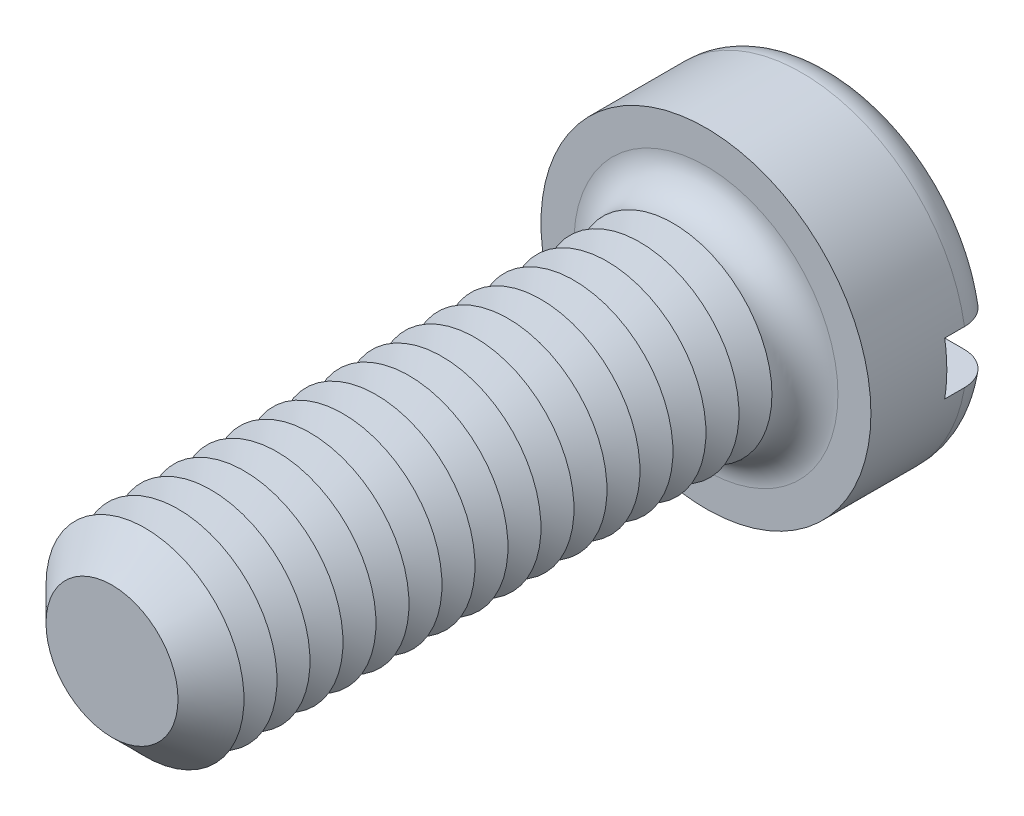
ISO-10303-21;
HEADER;
FILE_DESCRIPTION(('STEP AP214'),'2;1');
FILE_NAME('part.step','',(''),(''),'','','');
FILE_SCHEMA(('AUTOMOTIVE_DESIGN { 1 0 10303 214 1 1 1 1 }'));
ENDSEC;
DATA;
#1=APPLICATION_CONTEXT('core data for automotive mechanical design processes');
#2=APPLICATION_PROTOCOL_DEFINITION('international standard','automotive_design',2000,#1);
#3=PRODUCT_CONTEXT('',#1,'mechanical');
#4=PRODUCT('Part','Part','',(#3));
#5=PRODUCT_RELATED_PRODUCT_CATEGORY('part','',(#4));
#6=PRODUCT_DEFINITION_FORMATION('','',#4);
#7=PRODUCT_DEFINITION_CONTEXT('part definition',#1,'design');
#8=PRODUCT_DEFINITION('design','',#6,#7);
#9=PRODUCT_DEFINITION_SHAPE('','',#8);
#10=(LENGTH_UNIT() NAMED_UNIT(*) SI_UNIT(.MILLI.,.METRE.));
#11=(NAMED_UNIT(*) PLANE_ANGLE_UNIT() SI_UNIT($,.RADIAN.));
#12=(NAMED_UNIT(*) SI_UNIT($,.STERADIAN.) SOLID_ANGLE_UNIT());
#13=UNCERTAINTY_MEASURE_WITH_UNIT(LENGTH_MEASURE(1.E-05),#10,'distance_accuracy_value','');
#14=(GEOMETRIC_REPRESENTATION_CONTEXT(3) GLOBAL_UNCERTAINTY_ASSIGNED_CONTEXT((#13)) GLOBAL_UNIT_ASSIGNED_CONTEXT((#10,
#11,#12)) REPRESENTATION_CONTEXT('',''));
#15=CARTESIAN_POINT('',(0.,0.,0.));
#16=DIRECTION('',(0.,0.,1.));
#17=DIRECTION('',(1.,0.,0.));
#18=AXIS2_PLACEMENT_3D('',#15,#16,#17);
#19=CARTESIAN_POINT('',(0.,0.,-3.9));
#20=DIRECTION('',(0.,0.,1.));
#21=DIRECTION('',(1.,0.,0.));
#22=AXIS2_PLACEMENT_3D('',#19,#20,#21);
#23=PLANE('',#22);
#24=CARTESIAN_POINT('',(0.,0.,-3.9));
#25=DIRECTION('',(0.,0.,1.));
#26=DIRECTION('',(1.,0.,0.));
#27=AXIS2_PLACEMENT_3D('',#24,#25,#26);
#28=CIRCLE('',#27,4.);
#29=CARTESIAN_POINT('',(-3.91918358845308,0.800000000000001,-3.9));
#30=VERTEX_POINT('',#29);
#31=CARTESIAN_POINT('',(3.91918358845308,0.8,-3.9));
#32=VERTEX_POINT('',#31);
#33=EDGE_CURVE('E116',#30,#32,#28,.F.);
#34=ORIENTED_EDGE('',*,*,#33,.T.);
#35=DIRECTION('',(1.,0.,0.));
#36=VECTOR('',#35,1.);
#37=CARTESIAN_POINT('',(-5.,0.800000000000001,-3.9));
#38=LINE('',#37,#36);
#39=EDGE_CURVE('E111',#30,#32,#38,.T.);
#40=ORIENTED_EDGE('',*,*,#39,.F.);
#41=EDGE_LOOP('',(#34,#40));
#42=FACE_BOUND('',#41,.T.);
#43=ADVANCED_FACE('F39',(#42),#23,.F.);
#44=CARTESIAN_POINT('',(0.,0.,-2.9));
#45=DIRECTION('',(0.,0.,1.));
#46=DIRECTION('',(1.,0.,0.));
#47=AXIS2_PLACEMENT_3D('',#44,#45,#46);
#48=TOROIDAL_SURFACE('',#47,4.,1.);
#49=CARTESIAN_POINT('',(-4.76648512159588,0.800000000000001,-3.45304061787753));
#50=CARTESIAN_POINT('',(-4.73486405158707,0.800000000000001,-3.50001565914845));
#51=CARTESIAN_POINT('',(-4.69920787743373,0.800000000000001,-3.54432871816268));
#52=CARTESIAN_POINT('',(-4.62090302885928,0.800000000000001,-3.62634638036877));
#53=CARTESIAN_POINT('',(-4.57824494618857,0.800000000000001,-3.66404194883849));
#54=CARTESIAN_POINT('',(-4.48726975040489,0.800000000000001,-3.73172278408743));
#55=CARTESIAN_POINT('',(-4.43895902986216,0.800000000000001,-3.76171664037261));
#56=CARTESIAN_POINT('',(-4.33804923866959,0.800000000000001,-3.81326437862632));
#57=CARTESIAN_POINT('',(-4.2854512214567,0.800000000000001,-3.8348203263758));
#58=CARTESIAN_POINT('',(-4.17679895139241,0.800000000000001,-3.86918431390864));
#59=CARTESIAN_POINT('',(-4.12071163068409,0.800000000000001,-3.88188775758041));
#60=CARTESIAN_POINT('',(-4.00720729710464,0.800000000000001,-3.89785932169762));
#61=CARTESIAN_POINT('',(-3.94979011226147,0.800000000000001,-3.9011262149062));
#62=CARTESIAN_POINT('',(-3.83429042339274,0.800000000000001,-3.89816676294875));
#63=CARTESIAN_POINT('',(-3.77621176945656,0.800000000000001,-3.89178937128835));
#64=CARTESIAN_POINT('',(-3.66191938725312,0.800000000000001,-3.8694726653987));
#65=CARTESIAN_POINT('',(-3.60570580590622,0.800000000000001,-3.85353259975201));
#66=CARTESIAN_POINT('',(-3.49618749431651,0.800000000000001,-3.81233202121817));
#67=CARTESIAN_POINT('',(-3.44291561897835,0.800000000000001,-3.78698406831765));
#68=CARTESIAN_POINT('',(-3.34140774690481,0.800000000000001,-3.72766098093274));
#69=CARTESIAN_POINT('',(-3.29317182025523,0.800000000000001,-3.69368572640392));
#70=CARTESIAN_POINT('',(-3.20343355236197,0.800000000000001,-3.6182054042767));
#71=CARTESIAN_POINT('',(-3.16189680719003,0.800000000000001,-3.57674128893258));
#72=CARTESIAN_POINT('',(-3.08658236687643,0.800000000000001,-3.48727547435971));
#73=CARTESIAN_POINT('',(-3.05280364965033,0.800000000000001,-3.43927463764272));
#74=CARTESIAN_POINT('',(-2.99489532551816,0.800000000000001,-3.33932895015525));
#75=CARTESIAN_POINT('',(-2.97055012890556,0.800000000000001,-3.28750911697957));
#76=CARTESIAN_POINT('',(-2.93124252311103,0.800000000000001,-3.18042600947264));
#77=CARTESIAN_POINT('',(-2.91627793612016,0.800000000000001,-3.12516353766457));
#78=CARTESIAN_POINT('',(-2.89663075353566,0.800000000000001,-3.01470560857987));
#79=CARTESIAN_POINT('',(-2.89162828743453,0.800000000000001,-2.95956691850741));
#80=CARTESIAN_POINT('',(-2.89112479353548,0.800000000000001,-2.84924961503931));
#81=CARTESIAN_POINT('',(-2.89562264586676,0.800000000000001,-2.79407100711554));
#82=CARTESIAN_POINT('',(-2.91379565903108,0.800000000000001,-2.6861912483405));
#83=CARTESIAN_POINT('',(-2.92731815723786,0.800000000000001,-2.63346424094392));
#84=CARTESIAN_POINT('',(-2.96290888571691,0.800000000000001,-2.53098203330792));
#85=CARTESIAN_POINT('',(-2.98497757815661,0.800000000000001,-2.48122699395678));
#86=CARTESIAN_POINT('',(-3.03728055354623,0.800000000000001,-2.38535286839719));
#87=CARTESIAN_POINT('',(-3.06761989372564,0.800000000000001,-2.33929117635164));
#88=CARTESIAN_POINT('',(-3.13537950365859,0.800000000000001,-2.2527125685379));
#89=CARTESIAN_POINT('',(-3.17280082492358,0.800000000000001,-2.21219647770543));
#90=CARTESIAN_POINT('',(-3.2549164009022,0.800000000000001,-2.13651195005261));
#91=CARTESIAN_POINT('',(-3.29980186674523,0.800000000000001,-2.10155095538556));
#92=CARTESIAN_POINT('',(-3.39467666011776,0.800000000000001,-2.03942270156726));
#93=CARTESIAN_POINT('',(-3.44466673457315,0.800000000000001,-2.01225658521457));
#94=CARTESIAN_POINT('',(-3.5497933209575,0.800000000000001,-1.96576935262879));
#95=CARTESIAN_POINT('',(-3.60503228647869,0.800000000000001,-1.94667963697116));
#96=CARTESIAN_POINT('',(-3.71791613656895,0.800000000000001,-1.91794308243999));
#97=CARTESIAN_POINT('',(-3.77556119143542,0.800000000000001,-1.90829691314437));
#98=CARTESIAN_POINT('',(-3.89221522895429,0.800000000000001,-1.89869331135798));
#99=CARTESIAN_POINT('',(-3.9512319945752,0.800000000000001,-1.89882985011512));
#100=CARTESIAN_POINT('',(-4.06839541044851,0.800000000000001,-1.90907818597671));
#101=CARTESIAN_POINT('',(-4.12654207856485,0.800000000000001,-1.91918977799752));
#102=CARTESIAN_POINT('',(-4.23988103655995,0.800000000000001,-1.9490667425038));
#103=CARTESIAN_POINT('',(-4.29509069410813,0.800000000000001,-1.96876615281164));
#104=CARTESIAN_POINT('',(-4.40134194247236,0.800000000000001,-2.01729572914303));
#105=CARTESIAN_POINT('',(-4.45238383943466,0.800000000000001,-2.04612522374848));
#106=CARTESIAN_POINT('',(-4.54801343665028,0.800000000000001,-2.1116316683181));
#107=CARTESIAN_POINT('',(-4.59268768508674,0.800000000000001,-2.14818225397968));
#108=CARTESIAN_POINT('',(-4.67513924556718,0.800000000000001,-2.22837632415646));
#109=CARTESIAN_POINT('',(-4.71291715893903,0.800000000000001,-2.27201918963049));
#110=CARTESIAN_POINT('',(-4.77986554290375,0.800000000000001,-2.36439990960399));
#111=CARTESIAN_POINT('',(-4.80916462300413,0.800000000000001,-2.41304457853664));
#112=CARTESIAN_POINT('',(-4.85906149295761,0.800000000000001,-2.51460659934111));
#113=CARTESIAN_POINT('',(-4.8796602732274,0.800000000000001,-2.56752346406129));
#114=CARTESIAN_POINT('',(-4.9113264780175,0.800000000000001,-2.67542592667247));
#115=CARTESIAN_POINT('',(-4.92250819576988,0.800000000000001,-2.73037800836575));
#116=CARTESIAN_POINT('',(-4.93542682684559,0.800000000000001,-2.84139649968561));
#117=CARTESIAN_POINT('',(-4.93716171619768,0.800000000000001,-2.89746314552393));
#118=CARTESIAN_POINT('',(-4.93114851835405,0.800000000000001,-3.00876455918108));
#119=CARTESIAN_POINT('',(-4.92345325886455,0.800000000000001,-3.0640022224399));
#120=CARTESIAN_POINT('',(-4.8989032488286,0.800000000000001,-3.17235240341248));
#121=CARTESIAN_POINT('',(-4.88205998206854,0.800000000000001,-3.22546749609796));
#122=CARTESIAN_POINT('',(-4.84819200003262,0.800000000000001,-3.30764066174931));
#123=CARTESIAN_POINT('',(-4.83390853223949,0.800000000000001,-3.33785845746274));
#124=CARTESIAN_POINT('',(-4.80237957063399,0.800000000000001,-3.39670633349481));
#125=CARTESIAN_POINT('',(-4.78513409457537,0.800000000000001,-3.42533642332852));
#126=CARTESIAN_POINT('',(-4.76648512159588,0.800000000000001,-3.45304061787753));
#127=B_SPLINE_CURVE_WITH_KNOTS('',3,(#49,#50,#51,#52,#53,#54,#55,#56,#57,#58,#59,#60,#61,#62,
#63,#64,#65,#66,#67,#68,#69,#70,#71,#72,#73,#74,#75,#76,#77,#78,#79,#80,#81,#82,#83,#84,#85,#86,
#87,#88,#89,#90,#91,#92,#93,#94,#95,#96,#97,#98,#99,#100,#101,#102,#103,#104,#105,#106,#107,
#108,#109,#110,#111,#112,#113,#114,#115,#116,#117,#118,#119,#120,#121,#122,#123,#124,#125,#126),
.UNSPECIFIED.,.T.,.F.,(4,2,2,2,2,2,2,2,2,2,2,2,2,2,2,2,2,2,2,2,2,2,2,2,2,2,2,2,2,2,2,2,2,2,2,2,
2,2,4),(0.,0.169755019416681,0.339740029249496,0.509534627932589,0.67928763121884,
0.851013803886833,1.02276230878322,1.19722869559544,1.37170879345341,1.54785292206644,
1.72399950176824,1.89921049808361,2.07439839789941,2.24530597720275,2.41617386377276,
2.58146078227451,2.74672821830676,2.90926852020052,3.0718176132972,3.2365363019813,
3.40127946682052,3.57118676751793,3.74111896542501,3.91563534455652,4.09016409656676,
4.26636956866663,4.4425714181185,4.61757781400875,4.79257134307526,4.96489650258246,
5.13720662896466,5.30674670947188,5.47626748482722,5.64369988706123,5.81116816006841,
5.97770254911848,6.14402836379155,6.24414438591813,6.34425980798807),.UNSPECIFIED.);
#128=CARTESIAN_POINT('',(-4.93558507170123,0.800000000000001,-2.9));
#129=VERTEX_POINT('',#128);
#130=EDGE_CURVE('E307',#129,#30,#127,.T.);
#131=ORIENTED_EDGE('',*,*,#130,.F.);
#132=CARTESIAN_POINT('',(0.,0.,-2.9));
#133=DIRECTION('',(0.,0.,1.));
#134=DIRECTION('',(1.,0.,0.));
#135=AXIS2_PLACEMENT_3D('',#132,#133,#134);
#136=CIRCLE('',#135,5.);
#137=CARTESIAN_POINT('',(4.93558507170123,0.8,-2.9));
#138=VERTEX_POINT('',#137);
#139=EDGE_CURVE('E125',#138,#129,#136,.T.);
#140=ORIENTED_EDGE('',*,*,#139,.F.);
#141=CARTESIAN_POINT('',(2.98553785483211,0.8,-3.31649797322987));
#142=CARTESIAN_POINT('',(3.00991125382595,0.8,-3.36788093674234));
#143=CARTESIAN_POINT('',(3.03875556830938,0.8,-3.41719756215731));
#144=CARTESIAN_POINT('',(3.1043993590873,0.8,-3.51028676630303));
#145=CARTESIAN_POINT('',(3.1412115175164,0.8,-3.55405032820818));
#146=CARTESIAN_POINT('',(3.22153641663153,0.8,-3.63476402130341));
#147=CARTESIAN_POINT('',(3.26503706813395,0.8,-3.67172618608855));
#148=CARTESIAN_POINT('',(3.35749627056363,0.8,-3.73799476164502));
#149=CARTESIAN_POINT('',(3.4064533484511,0.8,-3.76730323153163));
#150=CARTESIAN_POINT('',(3.5095773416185,0.8,-3.81809642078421));
#151=CARTESIAN_POINT('',(3.56383317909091,0.8,-3.83940072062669));
#152=CARTESIAN_POINT('',(3.67513017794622,0.8,-3.87272481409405));
#153=CARTESIAN_POINT('',(3.7321717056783,0.8,-3.88474338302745));
#154=CARTESIAN_POINT('',(3.84815688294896,0.8,-3.89923413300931));
#155=CARTESIAN_POINT('',(3.90711516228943,0.8,-3.9015896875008));
#156=CARTESIAN_POINT('',(4.02458610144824,0.8,-3.89631753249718));
#157=CARTESIAN_POINT('',(4.08309876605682,0.8,-3.8886899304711));
#158=CARTESIAN_POINT('',(4.19768646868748,0.8,-3.86366584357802));
#159=CARTESIAN_POINT('',(4.25377243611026,0.8,-3.84631948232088));
#160=CARTESIAN_POINT('',(4.3621676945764,0.8,-3.80231797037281));
#161=CARTESIAN_POINT('',(4.41447726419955,0.8,-3.77566350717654));
#162=CARTESIAN_POINT('',(4.51300872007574,0.8,-3.71421163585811));
#163=CARTESIAN_POINT('',(4.5593085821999,0.8,-3.67953927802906));
#164=CARTESIAN_POINT('',(4.64530675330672,0.8,-3.60279495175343));
#165=CARTESIAN_POINT('',(4.68500564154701,0.8,-3.56072363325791));
#166=CARTESIAN_POINT('',(4.75599202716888,0.8,-3.47111750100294));
#167=CARTESIAN_POINT('',(4.7874061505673,0.8,-3.42368298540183));
#168=CARTESIAN_POINT('',(4.84170328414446,0.8,-3.32415927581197));
#169=CARTESIAN_POINT('',(4.86458695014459,0.8,-3.2720704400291));
#170=CARTESIAN_POINT('',(4.90088120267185,0.8,-3.16544016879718));
#171=CARTESIAN_POINT('',(4.91440984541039,0.8,-3.11093889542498));
#172=CARTESIAN_POINT('',(4.93205429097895,0.8,-3.00043391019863));
#173=CARTESIAN_POINT('',(4.93617053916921,0.8,-2.9444302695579));
#174=CARTESIAN_POINT('',(4.93486973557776,0.8,-2.83292218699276));
#175=CARTESIAN_POINT('',(4.92951827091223,0.8,-2.77741696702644));
#176=CARTESIAN_POINT('',(4.90957104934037,0.8,-2.66809456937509));
#177=CARTESIAN_POINT('',(4.89497541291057,0.8,-2.61427736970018));
#178=CARTESIAN_POINT('',(4.85697876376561,0.8,-2.50985095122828));
#179=CARTESIAN_POINT('',(4.83357805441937,0.8,-2.45924162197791));
#180=CARTESIAN_POINT('',(4.77866660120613,0.8,-2.36263484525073));
#181=CARTESIAN_POINT('',(4.74715567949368,0.8,-2.31663749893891));
#182=CARTESIAN_POINT('',(4.67670791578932,0.8,-2.23021464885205));
#183=CARTESIAN_POINT('',(4.6377224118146,0.8,-2.1898288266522));
#184=CARTESIAN_POINT('',(4.55359880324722,0.8,-2.11607828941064));
#185=CARTESIAN_POINT('',(4.50846036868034,0.8,-2.08271395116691));
#186=CARTESIAN_POINT('',(4.41271544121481,0.8,-2.02349513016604));
#187=CARTESIAN_POINT('',(4.36204749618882,0.8,-1.99774003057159));
#188=CARTESIAN_POINT('',(4.257155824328,0.8,-1.95495040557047));
#189=CARTESIAN_POINT('',(4.20293181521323,0.8,-1.93791657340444));
#190=CARTESIAN_POINT('',(4.09154156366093,0.8,-1.91276335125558));
#191=CARTESIAN_POINT('',(4.03434212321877,0.8,-1.90479098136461));
#192=CARTESIAN_POINT('',(3.91941228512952,0.8,-1.89840884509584));
#193=CARTESIAN_POINT('',(3.8616818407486,0.8,-1.89999992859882));
#194=CARTESIAN_POINT('',(3.7464111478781,0.8,-1.91275144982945));
#195=CARTESIAN_POINT('',(3.6888866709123,0.8,-1.92405471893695));
#196=CARTESIAN_POINT('',(3.57652290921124,0.8,-1.95609086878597));
#197=CARTESIAN_POINT('',(3.52168382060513,0.8,-1.97682443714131));
#198=CARTESIAN_POINT('',(3.41589179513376,0.8,-2.02733294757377));
#199=CARTESIAN_POINT('',(3.36496676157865,0.8,-2.05716640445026));
#200=CARTESIAN_POINT('',(3.26890903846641,0.8,-2.12504079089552));
#201=CARTESIAN_POINT('',(3.22377627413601,0.8,-2.16308161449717));
#202=CARTESIAN_POINT('',(3.141135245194,0.8,-2.24593284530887));
#203=CARTESIAN_POINT('',(3.1035541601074,0.8,-2.29067053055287));
#204=CARTESIAN_POINT('',(3.03669700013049,0.8,-2.38597317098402));
#205=CARTESIAN_POINT('',(3.00741914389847,0.8,-2.43653687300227));
#206=CARTESIAN_POINT('',(2.95891799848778,0.8,-2.54052959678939));
#207=CARTESIAN_POINT('',(2.93943249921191,0.8,-2.59383627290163));
#208=CARTESIAN_POINT('',(2.9100081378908,0.8,-2.70303736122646));
#209=CARTESIAN_POINT('',(2.90006970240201,0.8,-2.75893188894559));
#210=CARTESIAN_POINT('',(2.89027863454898,0.8,-2.86986958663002));
#211=CARTESIAN_POINT('',(2.89012791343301,0.8,-2.92488680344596));
#212=CARTESIAN_POINT('',(2.89917145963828,0.8,-3.03409648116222));
#213=CARTESIAN_POINT('',(2.90835313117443,0.8,-3.08828995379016));
#214=CARTESIAN_POINT('',(2.92977618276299,0.8,-3.17141652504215));
#215=CARTESIAN_POINT('',(2.93899011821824,0.8,-3.20116372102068));
#216=CARTESIAN_POINT('',(2.96020249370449,0.8,-3.25964614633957));
#217=CARTESIAN_POINT('',(2.97220082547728,0.8,-3.28838141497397));
#218=CARTESIAN_POINT('',(2.98553785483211,0.8,-3.31649797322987));
#219=B_SPLINE_CURVE_WITH_KNOTS('',3,(#141,#142,#143,#144,#145,#146,#147,#148,#149,#150,#151,
#152,#153,#154,#155,#156,#157,#158,#159,#160,#161,#162,#163,#164,#165,#166,#167,#168,#169,#170,
#171,#172,#173,#174,#175,#176,#177,#178,#179,#180,#181,#182,#183,#184,#185,#186,#187,#188,#189,
#190,#191,#192,#193,#194,#195,#196,#197,#198,#199,#200,#201,#202,#203,#204,#205,#206,#207,#208,
#209,#210,#211,#212,#213,#214,#215,#216,#217,#218),.UNSPECIFIED.,.T.,.F.,(4,2,2,2,2,2,2,2,2,2,2,
2,2,2,2,2,2,2,2,2,2,2,2,2,2,2,2,2,2,2,2,2,2,2,2,2,2,2,4),(0.,0.170493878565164,
0.341261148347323,0.511723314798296,0.682139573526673,0.856194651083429,1.03027268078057,
1.20644565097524,1.38261672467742,1.55788746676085,1.73314526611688,1.90583484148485,
2.07850925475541,2.24836742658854,2.41821253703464,2.58587311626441,2.75352576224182,
2.92002154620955,3.08651516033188,3.25300303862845,3.41949456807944,3.58710926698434,
3.75473295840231,3.92445790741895,4.09419634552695,4.26665110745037,4.43912119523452,
4.61417197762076,4.78923552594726,4.96544940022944,5.1416609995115,5.31608191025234,
5.49046537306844,5.65989063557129,5.82932346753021,5.99359365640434,6.157642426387,
6.250939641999,6.34423323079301),.UNSPECIFIED.);
#220=EDGE_CURVE('E309',#32,#138,#219,.T.);
#221=ORIENTED_EDGE('',*,*,#220,.F.);
#222=ORIENTED_EDGE('',*,*,#33,.F.);
#223=EDGE_LOOP('',(#131,#140,#221,#222));
#224=FACE_BOUND('',#223,.T.);
#225=ADVANCED_FACE('F291',(#224),#48,.T.);
#226=CARTESIAN_POINT('',(0.,0.,-3.9));
#227=DIRECTION('',(0.,0.,1.));
#228=DIRECTION('',(1.,0.,0.));
#229=AXIS2_PLACEMENT_3D('',#226,#227,#228);
#230=CYLINDRICAL_SURFACE('',#229,5.);
#231=DIRECTION('',(0.,0.,1.));
#232=VECTOR('',#231,1.);
#233=CARTESIAN_POINT('',(4.93558507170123,0.8,-3.9));
#234=LINE('',#233,#232);
#235=CARTESIAN_POINT('',(4.93558507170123,0.8,-2.3));
#236=VERTEX_POINT('',#235);
#237=EDGE_CURVE('E323',#138,#236,#234,.T.);
#238=ORIENTED_EDGE('',*,*,#237,.F.);
#239=ORIENTED_EDGE('',*,*,#139,.T.);
#240=DIRECTION('',(0.,0.,1.));
#241=VECTOR('',#240,1.);
#242=CARTESIAN_POINT('',(-4.93558507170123,0.800000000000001,-3.9));
#243=LINE('',#242,#241);
#244=CARTESIAN_POINT('',(-4.93558507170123,0.800000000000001,-2.3));
#245=VERTEX_POINT('',#244);
#246=EDGE_CURVE('E63',#245,#129,#243,.F.);
#247=ORIENTED_EDGE('',*,*,#246,.F.);
#248=CARTESIAN_POINT('',(0.,0.,-2.3));
#249=DIRECTION('',(0.,0.,-1.));
#250=DIRECTION('',(-1.,0.,0.));
#251=AXIS2_PLACEMENT_3D('',#248,#249,#250);
#252=CIRCLE('',#251,5.);
#253=CARTESIAN_POINT('',(-4.93558507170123,-0.799999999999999,-2.3));
#254=VERTEX_POINT('',#253);
#255=EDGE_CURVE('E43',#245,#254,#252,.F.);
#256=ORIENTED_EDGE('',*,*,#255,.T.);
#257=DIRECTION('',(0.,0.,1.));
#258=VECTOR('',#257,1.);
#259=CARTESIAN_POINT('',(-4.93558507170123,-0.799999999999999,-3.9));
#260=LINE('',#259,#258);
#261=CARTESIAN_POINT('',(-4.93558507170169,-0.799999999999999,-2.89999999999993));
#262=VERTEX_POINT('',#261);
#263=EDGE_CURVE('E320',#262,#254,#260,.T.);
#264=ORIENTED_EDGE('',*,*,#263,.F.);
#265=CARTESIAN_POINT('',(4.93558507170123,-0.8,-2.9));
#266=VERTEX_POINT('',#265);
#267=EDGE_CURVE('E127',#262,#266,#136,.T.);
#268=ORIENTED_EDGE('',*,*,#267,.T.);
#269=DIRECTION('',(0.,0.,1.));
#270=VECTOR('',#269,1.);
#271=CARTESIAN_POINT('',(4.93558507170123,-0.8,-3.9));
#272=LINE('',#271,#270);
#273=CARTESIAN_POINT('',(4.93558507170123,-0.8,-2.3));
#274=VERTEX_POINT('',#273);
#275=EDGE_CURVE('E55',#274,#266,#272,.F.);
#276=ORIENTED_EDGE('',*,*,#275,.F.);
#277=EDGE_CURVE('E11',#274,#236,#252,.F.);
#278=ORIENTED_EDGE('',*,*,#277,.T.);
#279=EDGE_LOOP('',(#238,#239,#247,#256,#264,#268,#276,#278));
#280=FACE_BOUND('',#279,.T.);
#281=CARTESIAN_POINT('',(0.,0.,0.));
#282=DIRECTION('',(0.,0.,1.));
#283=DIRECTION('',(1.,0.,0.));
#284=AXIS2_PLACEMENT_3D('',#281,#282,#283);
#285=CIRCLE('',#284,5.);
#286=CARTESIAN_POINT('',(5.,0.,0.));
#287=VERTEX_POINT('',#286);
#288=EDGE_CURVE('E326',#287,#287,#285,.T.);
#289=ORIENTED_EDGE('',*,*,#288,.F.);
#290=EDGE_LOOP('',(#289));
#291=FACE_BOUND('',#290,.T.);
#292=ADVANCED_FACE('F287',(#280,#291),#230,.T.);
#293=CARTESIAN_POINT('',(3.91918358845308,-0.8,-3.9));
#294=VERTEX_POINT('',#293);
#295=CARTESIAN_POINT('',(-3.91918358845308,-0.799999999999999,-3.9));
#296=VERTEX_POINT('',#295);
#297=EDGE_CURVE('E109',#294,#296,#28,.F.);
#298=ORIENTED_EDGE('',*,*,#297,.T.);
#299=DIRECTION('',(-1.,0.,0.));
#300=VECTOR('',#299,1.);
#301=CARTESIAN_POINT('',(-5.,-0.799999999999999,-3.9));
#302=LINE('',#301,#300);
#303=EDGE_CURVE('E96',#294,#296,#302,.T.);
#304=ORIENTED_EDGE('',*,*,#303,.F.);
#305=EDGE_LOOP('',(#298,#304));
#306=FACE_BOUND('',#305,.T.);
#307=ADVANCED_FACE('F108',(#306),#23,.F.);
#308=CARTESIAN_POINT('',(0.,0.,0.));
#309=DIRECTION('',(0.,0.,1.));
#310=DIRECTION('',(1.,0.,0.));
#311=AXIS2_PLACEMENT_3D('',#308,#309,#310);
#312=PLANE('',#311);
#313=CARTESIAN_POINT('',(0.,0.,0.));
#314=DIRECTION('',(0.,0.,1.));
#315=DIRECTION('',(1.,0.,0.));
#316=AXIS2_PLACEMENT_3D('',#313,#314,#315);
#317=CIRCLE('',#316,4.);
#318=CARTESIAN_POINT('',(4.,0.,0.));
#319=VERTEX_POINT('',#318);
#320=EDGE_CURVE('E115',#319,#319,#317,.F.);
#321=ORIENTED_EDGE('',*,*,#320,.T.);
#322=EDGE_LOOP('',(#321));
#323=FACE_BOUND('',#322,.T.);
#324=ORIENTED_EDGE('',*,*,#288,.T.);
#325=EDGE_LOOP('',(#324));
#326=FACE_BOUND('',#325,.T.);
#327=ADVANCED_FACE('F286',(#323,#326),#312,.T.);
#328=CARTESIAN_POINT('',(-4.76648512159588,-0.799999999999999,-3.45304061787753));
#329=CARTESIAN_POINT('',(-4.7975694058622,-0.799999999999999,-3.40685392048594));
#330=CARTESIAN_POINT('',(-4.82479903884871,-0.799999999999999,-3.35802740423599));
#331=CARTESIAN_POINT('',(-4.87070632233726,-0.799999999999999,-3.25646127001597));
#332=CARTESIAN_POINT('',(-4.8893747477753,-0.799999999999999,-3.20371750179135));
#333=CARTESIAN_POINT('',(-4.91756720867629,-0.799999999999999,-3.09584501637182));
#334=CARTESIAN_POINT('',(-4.92709302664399,-0.799999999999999,-3.04071676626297));
#335=CARTESIAN_POINT('',(-4.93671217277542,-0.799999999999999,-2.92965669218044));
#336=CARTESIAN_POINT('',(-4.93680767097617,-0.799999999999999,-2.87372505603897));
#337=CARTESIAN_POINT('',(-4.92758675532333,-0.799999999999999,-2.76284675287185));
#338=CARTESIAN_POINT('',(-4.91830421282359,-0.799999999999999,-2.70789726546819));
#339=CARTESIAN_POINT('',(-4.89065741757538,-0.799999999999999,-2.60033228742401));
#340=CARTESIAN_POINT('',(-4.87229291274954,-0.799999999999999,-2.54771686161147));
#341=CARTESIAN_POINT('',(-4.82699855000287,-0.799999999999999,-2.44622441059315));
#342=CARTESIAN_POINT('',(-4.80005659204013,-0.799999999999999,-2.39735278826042));
#343=CARTESIAN_POINT('',(-4.73841244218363,-0.799999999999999,-2.30477947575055));
#344=CARTESIAN_POINT('',(-4.70371003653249,-0.799999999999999,-2.26107792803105));
#345=CARTESIAN_POINT('',(-4.62724516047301,-0.799999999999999,-2.17969334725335));
#346=CARTESIAN_POINT('',(-4.58542787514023,-0.799999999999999,-2.14206183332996));
#347=CARTESIAN_POINT('',(-4.49614171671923,-0.799999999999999,-2.07424284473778));
#348=CARTESIAN_POINT('',(-4.44867251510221,-0.799999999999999,-2.04405580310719));
#349=CARTESIAN_POINT('',(-4.34875035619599,-0.799999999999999,-1.99153688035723));
#350=CARTESIAN_POINT('',(-4.29623870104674,-0.799999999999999,-1.96931670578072));
#351=CARTESIAN_POINT('',(-4.18826905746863,-0.799999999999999,-1.93384994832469));
#352=CARTESIAN_POINT('',(-4.1328108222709,-0.799999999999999,-1.92060411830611));
#353=CARTESIAN_POINT('',(-4.01956054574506,-0.799999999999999,-1.90323798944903));
#354=CARTESIAN_POINT('',(-3.96174522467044,-0.799999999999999,-1.89926947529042));
#355=CARTESIAN_POINT('',(-3.84625419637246,-0.799999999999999,-1.90095183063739));
#356=CARTESIAN_POINT('',(-3.78857850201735,-0.799999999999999,-1.90660355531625));
#357=CARTESIAN_POINT('',(-3.67415602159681,-0.799999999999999,-1.92748272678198));
#358=CARTESIAN_POINT('',(-3.61743328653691,-0.799999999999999,-1.94284216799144));
#359=CARTESIAN_POINT('',(-3.50734962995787,-0.799999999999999,-1.9828275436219));
#360=CARTESIAN_POINT('',(-3.4539889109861,-0.799999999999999,-2.00745403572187));
#361=CARTESIAN_POINT('',(-3.35197118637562,-0.799999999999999,-2.06542964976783));
#362=CARTESIAN_POINT('',(-3.30333217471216,-0.799999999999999,-2.0988104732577));
#363=CARTESIAN_POINT('',(-3.21244692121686,-0.799999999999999,-2.17337326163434));
#364=CARTESIAN_POINT('',(-3.17020039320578,-0.799999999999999,-2.21455487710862));
#365=CARTESIAN_POINT('',(-3.0940098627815,-0.799999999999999,-2.30296695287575));
#366=CARTESIAN_POINT('',(-3.05995540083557,-0.799999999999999,-2.35010211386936));
#367=CARTESIAN_POINT('',(-3.00053815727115,-0.799999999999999,-2.4495670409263));
#368=CARTESIAN_POINT('',(-2.97517362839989,-0.799999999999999,-2.50189576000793));
#369=CARTESIAN_POINT('',(-2.93470320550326,-0.799999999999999,-2.60853979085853));
#370=CARTESIAN_POINT('',(-2.91930557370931,-0.799999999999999,-2.66274437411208));
#371=CARTESIAN_POINT('',(-2.89812734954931,-0.799999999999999,-2.77299836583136));
#372=CARTESIAN_POINT('',(-2.89234481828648,-0.799999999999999,-2.82904740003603));
#373=CARTESIAN_POINT('',(-2.89064073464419,-0.799999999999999,-2.93970612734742));
#374=CARTESIAN_POINT('',(-2.89444549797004,-0.799999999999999,-2.99431180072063));
#375=CARTESIAN_POINT('',(-2.9112006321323,-0.799999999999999,-3.10209766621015));
#376=CARTESIAN_POINT('',(-2.9241507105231,-0.799999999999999,-3.1552779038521));
#377=CARTESIAN_POINT('',(-2.95868580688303,-0.799999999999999,-3.25858631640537));
#378=CARTESIAN_POINT('',(-2.98024709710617,-0.799999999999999,-3.30872244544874));
#379=CARTESIAN_POINT('',(-3.03128544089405,-0.799999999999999,-3.40478519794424));
#380=CARTESIAN_POINT('',(-3.06076335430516,-0.799999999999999,-3.45071136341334));
#381=CARTESIAN_POINT('',(-3.12753448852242,-0.799999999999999,-3.53826932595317));
#382=CARTESIAN_POINT('',(-3.16500083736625,-0.799999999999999,-3.57976901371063));
#383=CARTESIAN_POINT('',(-3.24617503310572,-0.799999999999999,-3.65613204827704));
#384=CARTESIAN_POINT('',(-3.28988388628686,-0.799999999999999,-3.69099432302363));
#385=CARTESIAN_POINT('',(-3.38380639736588,-0.799999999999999,-3.75424083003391));
#386=CARTESIAN_POINT('',(-3.43418287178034,-0.799999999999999,-3.78238342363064));
#387=CARTESIAN_POINT('',(-3.53887888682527,-0.799999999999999,-3.83000231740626));
#388=CARTESIAN_POINT('',(-3.59319889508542,-0.799999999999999,-3.84947758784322));
#389=CARTESIAN_POINT('',(-3.70539237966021,-0.799999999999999,-3.87954336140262));
#390=CARTESIAN_POINT('',(-3.76331464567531,-0.799999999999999,-3.88995217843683));
#391=CARTESIAN_POINT('',(-3.88008461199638,-0.799999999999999,-3.9009132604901));
#392=CARTESIAN_POINT('',(-3.93893230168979,-0.799999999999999,-3.9014656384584));
#393=CARTESIAN_POINT('',(-4.05594892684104,-0.799999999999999,-3.89264187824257));
#394=CARTESIAN_POINT('',(-4.11411702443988,-0.799999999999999,-3.88325457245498));
#395=CARTESIAN_POINT('',(-4.22802928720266,-0.799999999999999,-3.85472582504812));
#396=CARTESIAN_POINT('',(-4.28377297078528,-0.799999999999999,-3.83558245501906));
#397=CARTESIAN_POINT('',(-4.39054463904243,-0.799999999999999,-3.78829842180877));
#398=CARTESIAN_POINT('',(-4.44161887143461,-0.799999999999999,-3.76026208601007));
#399=CARTESIAN_POINT('',(-4.53818016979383,-0.799999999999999,-3.69589278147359));
#400=CARTESIAN_POINT('',(-4.58367442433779,-0.799999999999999,-3.65957066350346));
#401=CARTESIAN_POINT('',(-4.65208830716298,-0.799999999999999,-3.59453310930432));
#402=CARTESIAN_POINT('',(-4.67711825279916,-0.799999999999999,-3.56800018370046));
#403=CARTESIAN_POINT('',(-4.72414423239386,-0.799999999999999,-3.51236863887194));
#404=CARTESIAN_POINT('',(-4.74614029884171,-0.799999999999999,-3.48327004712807));
#405=CARTESIAN_POINT('',(-4.76648512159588,-0.799999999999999,-3.45304061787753));
#406=B_SPLINE_CURVE_WITH_KNOTS('',3,(#328,#329,#330,#331,#332,#333,#334,#335,#336,#337,#338,
#339,#340,#341,#342,#343,#344,#345,#346,#347,#348,#349,#350,#351,#352,#353,#354,#355,#356,#357,
#358,#359,#360,#361,#362,#363,#364,#365,#366,#367,#368,#369,#370,#371,#372,#373,#374,#375,#376,
#377,#378,#379,#380,#381,#382,#383,#384,#385,#386,#387,#388,#389,#390,#391,#392,#393,#394,#395,
#396,#397,#398,#399,#400,#401,#402,#403,#404,#405),.UNSPECIFIED.,.T.,.F.,(4,2,2,2,2,2,2,2,2,2,2,
2,2,2,2,2,2,2,2,2,2,2,2,2,2,2,2,2,2,2,2,2,2,2,2,2,2,2,4),(0.,0.166886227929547,
0.333951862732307,0.500984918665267,0.667979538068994,0.834373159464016,1.00077139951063,
1.16740542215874,1.33404403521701,1.50202999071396,1.67002571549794,1.84029248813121,
2.01057354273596,2.18362161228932,2.35668506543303,2.53215380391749,2.70763310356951,
2.88375684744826,3.05987270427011,3.23346085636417,3.40701408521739,3.57522519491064,
3.74340238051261,3.90683338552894,4.0702591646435,4.23323770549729,4.39623395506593,
4.56320691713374,4.7302068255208,4.90252468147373,5.07486300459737,5.25058028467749,
5.42629555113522,5.60220844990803,5.77815613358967,5.95211162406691,6.12584060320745,
6.23506966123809,6.34429754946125),.UNSPECIFIED.);
#407=EDGE_CURVE('E103',#296,#262,#406,.T.);
#408=ORIENTED_EDGE('',*,*,#407,.F.);
#409=ORIENTED_EDGE('',*,*,#297,.F.);
#410=CARTESIAN_POINT('',(2.98553785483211,-0.8,-3.31649797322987));
#411=CARTESIAN_POINT('',(2.96216773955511,-0.8,-3.26721849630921));
#412=CARTESIAN_POINT('',(2.94287503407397,-0.8,-3.21596872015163));
#413=CARTESIAN_POINT('',(2.91313258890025,-0.8,-3.11092723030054));
#414=CARTESIAN_POINT('',(2.9026902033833,-0.8,-3.0571334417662));
#415=CARTESIAN_POINT('',(2.89104377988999,-0.8,-2.94853922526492));
#416=CARTESIAN_POINT('',(2.88984130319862,-0.8,-2.89373862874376));
#417=CARTESIAN_POINT('',(2.89672585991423,-0.8,-2.78473646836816));
#418=CARTESIAN_POINT('',(2.90481120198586,-0.8,-2.73053479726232));
#419=CARTESIAN_POINT('',(2.92989134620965,-0.8,-2.62460092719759));
#420=CARTESIAN_POINT('',(2.94682969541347,-0.8,-2.57285532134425));
#421=CARTESIAN_POINT('',(2.9889990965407,-0.8,-2.47286425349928));
#422=CARTESIAN_POINT('',(3.01423103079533,-0.8,-2.42461916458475));
#423=CARTESIAN_POINT('',(3.07271536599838,-0.8,-2.33201565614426));
#424=CARTESIAN_POINT('',(3.10610710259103,-0.8,-2.28774532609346));
#425=CARTESIAN_POINT('',(3.17963417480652,-0.8,-2.205215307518));
#426=CARTESIAN_POINT('',(3.21977054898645,-0.8,-2.16695654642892));
#427=CARTESIAN_POINT('',(3.3070361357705,-0.8,-2.09624274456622));
#428=CARTESIAN_POINT('',(3.35434874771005,-0.8,-2.06401396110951));
#429=CARTESIAN_POINT('',(3.45361131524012,-0.8,-2.00773436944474));
#430=CARTESIAN_POINT('',(3.50556189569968,-0.8,-1.98368466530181));
#431=CARTESIAN_POINT('',(3.61398433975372,-0.8,-1.94389460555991));
#432=CARTESIAN_POINT('',(3.67053506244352,-0.8,-1.92836880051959));
#433=CARTESIAN_POINT('',(3.78543606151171,-0.8,-1.90696594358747));
#434=CARTESIAN_POINT('',(3.84378643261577,-0.8,-1.90108940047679));
#435=CARTESIAN_POINT('',(3.96100201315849,-0.8,-1.89918115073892));
#436=CARTESIAN_POINT('',(4.01986821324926,-0.8,-1.90320860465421));
#437=CARTESIAN_POINT('',(4.13606891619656,-0.8,-1.9211820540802));
#438=CARTESIAN_POINT('',(4.19340347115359,-0.8,-1.93512771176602));
#439=CARTESIAN_POINT('',(4.30434213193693,-0.8,-1.97243705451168));
#440=CARTESIAN_POINT('',(4.35797549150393,-0.8,-1.99571368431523));
#441=CARTESIAN_POINT('',(4.46048254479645,-0.8,-2.0510826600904));
#442=CARTESIAN_POINT('',(4.50935662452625,-0.8,-2.08317429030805));
#443=CARTESIAN_POINT('',(4.60012348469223,-0.8,-2.15471647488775));
#444=CARTESIAN_POINT('',(4.64211506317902,-0.8,-2.19404167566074));
#445=CARTESIAN_POINT('',(4.71877054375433,-0.8,-2.27928299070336));
#446=CARTESIAN_POINT('',(4.75343508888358,-0.8,-2.32519852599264));
#447=CARTESIAN_POINT('',(4.81388799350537,-0.8,-2.4215411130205));
#448=CARTESIAN_POINT('',(4.83980652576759,-0.8,-2.47188650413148));
#449=CARTESIAN_POINT('',(4.88271402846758,-0.8,-2.57624865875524));
#450=CARTESIAN_POINT('',(4.89970360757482,-0.8,-2.63026517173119));
#451=CARTESIAN_POINT('',(4.92409334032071,-0.8,-2.73978844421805));
#452=CARTESIAN_POINT('',(4.93159814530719,-0.8,-2.79527191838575));
#453=CARTESIAN_POINT('',(4.93713723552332,-0.8,-2.90670881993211));
#454=CARTESIAN_POINT('',(4.9351718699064,-0.8,-2.9626622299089));
#455=CARTESIAN_POINT('',(4.92186293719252,-0.8,-3.07317093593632));
#456=CARTESIAN_POINT('',(4.91056393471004,-0.8,-3.12773160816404));
#457=CARTESIAN_POINT('',(4.87898532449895,-0.8,-3.234187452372));
#458=CARTESIAN_POINT('',(4.85870572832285,-0.8,-3.28608262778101));
#459=CARTESIAN_POINT('',(4.80971634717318,-0.8,-3.38586723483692));
#460=CARTESIAN_POINT('',(4.78098824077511,-0.8,-3.43374766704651));
#461=CARTESIAN_POINT('',(4.71596686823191,-0.8,-3.52405937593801));
#462=CARTESIAN_POINT('',(4.67967336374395,-0.8,-3.56649048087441));
#463=CARTESIAN_POINT('',(4.60022577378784,-0.8,-3.64511036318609));
#464=CARTESIAN_POINT('',(4.5570143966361,-0.8,-3.6812412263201));
#465=CARTESIAN_POINT('',(4.4652099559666,-0.8,-3.7458530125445));
#466=CARTESIAN_POINT('',(4.41661654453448,-0.8,-3.77433344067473));
#467=CARTESIAN_POINT('',(4.31470683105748,-0.8,-3.82326981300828));
#468=CARTESIAN_POINT('',(4.26133399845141,-0.8,-3.84360800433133));
#469=CARTESIAN_POINT('',(4.15196444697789,-0.8,-3.87519515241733));
#470=CARTESIAN_POINT('',(4.09596750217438,-0.8,-3.88644332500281));
#471=CARTESIAN_POINT('',(3.98196469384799,-0.8,-3.89971870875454));
#472=CARTESIAN_POINT('',(3.92394096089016,-0.8,-3.901592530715));
#473=CARTESIAN_POINT('',(3.8083852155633,-0.8,-3.89570840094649));
#474=CARTESIAN_POINT('',(3.75085322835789,-0.8,-3.88794995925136));
#475=CARTESIAN_POINT('',(3.6371167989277,-0.8,-3.86287824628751));
#476=CARTESIAN_POINT('',(3.58093962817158,-0.8,-3.84544111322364));
#477=CARTESIAN_POINT('',(3.47227948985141,-0.8,-3.80139971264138));
#478=CARTESIAN_POINT('',(3.41979762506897,-0.8,-3.77479272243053));
#479=CARTESIAN_POINT('',(3.31994061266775,-0.8,-3.71304199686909));
#480=CARTESIAN_POINT('',(3.27257854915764,-0.8,-3.67787710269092));
#481=CARTESIAN_POINT('',(3.18459619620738,-0.8,-3.59999704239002));
#482=CARTESIAN_POINT('',(3.14396747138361,-0.8,-3.55729146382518));
#483=CARTESIAN_POINT('',(3.08341110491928,-0.8,-3.48140072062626));
#484=CARTESIAN_POINT('',(3.06118126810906,-0.8,-3.45002448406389));
#485=CARTESIAN_POINT('',(3.02047302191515,-0.8,-3.38492378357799));
#486=CARTESIAN_POINT('',(3.00199451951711,-0.8,-3.35119937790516));
#487=CARTESIAN_POINT('',(2.98553785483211,-0.8,-3.31649797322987));
#488=B_SPLINE_CURVE_WITH_KNOTS('',3,(#410,#411,#412,#413,#414,#415,#416,#417,#418,#419,#420,
#421,#422,#423,#424,#425,#426,#427,#428,#429,#430,#431,#432,#433,#434,#435,#436,#437,#438,#439,
#440,#441,#442,#443,#444,#445,#446,#447,#448,#449,#450,#451,#452,#453,#454,#455,#456,#457,#458,
#459,#460,#461,#462,#463,#464,#465,#466,#467,#468,#469,#470,#471,#472,#473,#474,#475,#476,#477,
#478,#479,#480,#481,#482,#483,#484,#485,#486,#487),.UNSPECIFIED.,.T.,.F.,(4,2,2,2,2,2,2,2,2,2,2,
2,2,2,2,2,2,2,2,2,2,2,2,2,2,2,2,2,2,2,2,2,2,2,2,2,2,2,4),(0.,0.163484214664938,
0.327104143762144,0.490751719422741,0.654369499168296,0.816956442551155,0.979560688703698,
1.14516376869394,1.31079237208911,1.48174839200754,1.6527274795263,1.82783306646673,
2.00294788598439,2.17911127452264,2.35526866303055,2.52981944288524,2.70435605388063,
2.87611266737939,3.04785420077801,3.21691347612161,3.38596122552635,3.55312700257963,
3.72028661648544,3.88665268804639,4.053018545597,4.2197478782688,4.38648246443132,
4.55467705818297,4.72288253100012,4.89343959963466,5.06401138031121,5.23736524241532,
5.41072792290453,5.58636211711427,5.76204850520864,5.93817375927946,6.11407667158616,
6.22920111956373,6.34432271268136),.UNSPECIFIED.);
#489=EDGE_CURVE('E92',#266,#294,#488,.T.);
#490=ORIENTED_EDGE('',*,*,#489,.F.);
#491=ORIENTED_EDGE('',*,*,#267,.F.);
#492=EDGE_LOOP('',(#408,#409,#490,#491));
#493=FACE_BOUND('',#492,.T.);
#494=ADVANCED_FACE('F113',(#493),#48,.T.);
#495=CARTESIAN_POINT('',(0.,0.,1.));
#496=DIRECTION('',(0.,0.,1.));
#497=DIRECTION('',(1.,0.,0.));
#498=AXIS2_PLACEMENT_3D('',#495,#496,#497);
#499=TOROIDAL_SURFACE('',#498,4.,1.);
#500=ORIENTED_EDGE('',*,*,#320,.F.);
#501=EDGE_LOOP('',(#500));
#502=FACE_BOUND('',#501,.T.);
#503=CARTESIAN_POINT('',(0.,0.,1.));
#504=DIRECTION('',(0.,0.,-1.));
#505=DIRECTION('',(-1.,0.,0.));
#506=AXIS2_PLACEMENT_3D('',#503,#504,#505);
#507=CIRCLE('',#506,3.);
#508=CARTESIAN_POINT('',(-3.,0.,1.));
#509=VERTEX_POINT('',#508);
#510=EDGE_CURVE('E331',#509,#509,#507,.T.);
#511=ORIENTED_EDGE('',*,*,#510,.T.);
#512=EDGE_LOOP('',(#511));
#513=FACE_BOUND('',#512,.T.);
#514=ADVANCED_FACE('F279',(#502,#513),#499,.F.);
#515=CARTESIAN_POINT('',(0.,0.,1.5));
#516=DIRECTION('',(0.,0.,-1.));
#517=DIRECTION('',(-1.,0.,0.));
#518=AXIS2_PLACEMENT_3D('',#515,#516,#517);
#519=CONICAL_SURFACE('',#518,2.13397459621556,1.0471975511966);
#520=ORIENTED_EDGE('',*,*,#510,.F.);
#521=EDGE_LOOP('',(#520));
#522=FACE_BOUND('',#521,.T.);
#523=CARTESIAN_POINT('',(0.,0.,1.5));
#524=DIRECTION('',(0.,0.,-1.));
#525=DIRECTION('',(-1.,0.,0.));
#526=AXIS2_PLACEMENT_3D('',#523,#524,#525);
#527=CIRCLE('',#526,2.13397459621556);
#528=CARTESIAN_POINT('',(-2.13397459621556,0.,1.5));
#529=VERTEX_POINT('',#528);
#530=EDGE_CURVE('E338',#529,#529,#527,.T.);
#531=ORIENTED_EDGE('',*,*,#530,.T.);
#532=EDGE_LOOP('',(#531));
#533=FACE_BOUND('',#532,.T.);
#534=ADVANCED_FACE('F275',(#522,#533),#519,.T.);
#535=CARTESIAN_POINT('',(0.,0.,2.));
#536=DIRECTION('',(0.,0.,1.));
#537=DIRECTION('',(1.,0.,0.));
#538=AXIS2_PLACEMENT_3D('',#535,#536,#537);
#539=CONICAL_SURFACE('',#538,3.,1.0471975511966);
#540=ORIENTED_EDGE('',*,*,#530,.F.);
#541=EDGE_LOOP('',(#540));
#542=FACE_BOUND('',#541,.T.);
#543=CARTESIAN_POINT('',(0.,0.,2.));
#544=DIRECTION('',(0.,0.,-1.));
#545=DIRECTION('',(-1.,0.,0.));
#546=AXIS2_PLACEMENT_3D('',#543,#544,#545);
#547=CIRCLE('',#546,3.);
#548=CARTESIAN_POINT('',(-3.,0.,2.));
#549=VERTEX_POINT('',#548);
#550=EDGE_CURVE('E344',#549,#549,#547,.T.);
#551=ORIENTED_EDGE('',*,*,#550,.T.);
#552=EDGE_LOOP('',(#551));
#553=FACE_BOUND('',#552,.T.);
#554=ADVANCED_FACE('F271',(#542,#553),#539,.T.);
#555=CARTESIAN_POINT('',(0.,0.,2.5));
#556=DIRECTION('',(0.,0.,-1.));
#557=DIRECTION('',(-1.,0.,0.));
#558=AXIS2_PLACEMENT_3D('',#555,#556,#557);
#559=CONICAL_SURFACE('',#558,2.13397459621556,1.0471975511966);
#560=ORIENTED_EDGE('',*,*,#550,.F.);
#561=EDGE_LOOP('',(#560));
#562=FACE_BOUND('',#561,.T.);
#563=CARTESIAN_POINT('',(0.,0.,2.5));
#564=DIRECTION('',(0.,0.,-1.));
#565=DIRECTION('',(-1.,0.,0.));
#566=AXIS2_PLACEMENT_3D('',#563,#564,#565);
#567=CIRCLE('',#566,2.13397459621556);
#568=CARTESIAN_POINT('',(-2.13397459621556,0.,2.5));
#569=VERTEX_POINT('',#568);
#570=EDGE_CURVE('E348',#569,#569,#567,.T.);
#571=ORIENTED_EDGE('',*,*,#570,.T.);
#572=EDGE_LOOP('',(#571));
#573=FACE_BOUND('',#572,.T.);
#574=ADVANCED_FACE('F267',(#562,#573),#559,.T.);
#575=CARTESIAN_POINT('',(0.,0.,3.));
#576=DIRECTION('',(0.,0.,1.));
#577=DIRECTION('',(1.,0.,0.));
#578=AXIS2_PLACEMENT_3D('',#575,#576,#577);
#579=CONICAL_SURFACE('',#578,3.,1.0471975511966);
#580=ORIENTED_EDGE('',*,*,#570,.F.);
#581=EDGE_LOOP('',(#580));
#582=FACE_BOUND('',#581,.T.);
#583=CARTESIAN_POINT('',(0.,0.,3.));
#584=DIRECTION('',(0.,0.,-1.));
#585=DIRECTION('',(-1.,0.,0.));
#586=AXIS2_PLACEMENT_3D('',#583,#584,#585);
#587=CIRCLE('',#586,3.);
#588=CARTESIAN_POINT('',(-3.,0.,3.));
#589=VERTEX_POINT('',#588);
#590=EDGE_CURVE('E351',#589,#589,#587,.T.);
#591=ORIENTED_EDGE('',*,*,#590,.T.);
#592=EDGE_LOOP('',(#591));
#593=FACE_BOUND('',#592,.T.);
#594=ADVANCED_FACE('F263',(#582,#593),#579,.T.);
#595=CARTESIAN_POINT('',(0.,0.,3.5));
#596=DIRECTION('',(0.,0.,-1.));
#597=DIRECTION('',(-1.,0.,0.));
#598=AXIS2_PLACEMENT_3D('',#595,#596,#597);
#599=CONICAL_SURFACE('',#598,2.13397459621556,1.0471975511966);
#600=ORIENTED_EDGE('',*,*,#590,.F.);
#601=EDGE_LOOP('',(#600));
#602=FACE_BOUND('',#601,.T.);
#603=CARTESIAN_POINT('',(0.,0.,3.5));
#604=DIRECTION('',(0.,0.,-1.));
#605=DIRECTION('',(-1.,0.,0.));
#606=AXIS2_PLACEMENT_3D('',#603,#604,#605);
#607=CIRCLE('',#606,2.13397459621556);
#608=CARTESIAN_POINT('',(-2.13397459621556,0.,3.5));
#609=VERTEX_POINT('',#608);
#610=EDGE_CURVE('E355',#609,#609,#607,.T.);
#611=ORIENTED_EDGE('',*,*,#610,.T.);
#612=EDGE_LOOP('',(#611));
#613=FACE_BOUND('',#612,.T.);
#614=ADVANCED_FACE('F259',(#602,#613),#599,.T.);
#615=CARTESIAN_POINT('',(0.,0.,4.));
#616=DIRECTION('',(0.,0.,1.));
#617=DIRECTION('',(1.,0.,0.));
#618=AXIS2_PLACEMENT_3D('',#615,#616,#617);
#619=CONICAL_SURFACE('',#618,3.,1.0471975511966);
#620=ORIENTED_EDGE('',*,*,#610,.F.);
#621=EDGE_LOOP('',(#620));
#622=FACE_BOUND('',#621,.T.);
#623=CARTESIAN_POINT('',(0.,0.,4.));
#624=DIRECTION('',(0.,0.,-1.));
#625=DIRECTION('',(-1.,0.,0.));
#626=AXIS2_PLACEMENT_3D('',#623,#624,#625);
#627=CIRCLE('',#626,3.);
#628=CARTESIAN_POINT('',(-3.,0.,4.));
#629=VERTEX_POINT('',#628);
#630=EDGE_CURVE('E359',#629,#629,#627,.T.);
#631=ORIENTED_EDGE('',*,*,#630,.T.);
#632=EDGE_LOOP('',(#631));
#633=FACE_BOUND('',#632,.T.);
#634=ADVANCED_FACE('F255',(#622,#633),#619,.T.);
#635=CARTESIAN_POINT('',(0.,0.,4.5));
#636=DIRECTION('',(0.,0.,-1.));
#637=DIRECTION('',(-1.,0.,0.));
#638=AXIS2_PLACEMENT_3D('',#635,#636,#637);
#639=CONICAL_SURFACE('',#638,2.13397459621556,1.0471975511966);
#640=ORIENTED_EDGE('',*,*,#630,.F.);
#641=EDGE_LOOP('',(#640));
#642=FACE_BOUND('',#641,.T.);
#643=CARTESIAN_POINT('',(0.,0.,4.5));
#644=DIRECTION('',(0.,0.,-1.));
#645=DIRECTION('',(-1.,0.,0.));
#646=AXIS2_PLACEMENT_3D('',#643,#644,#645);
#647=CIRCLE('',#646,2.13397459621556);
#648=CARTESIAN_POINT('',(-2.13397459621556,0.,4.5));
#649=VERTEX_POINT('',#648);
#650=EDGE_CURVE('E363',#649,#649,#647,.T.);
#651=ORIENTED_EDGE('',*,*,#650,.T.);
#652=EDGE_LOOP('',(#651));
#653=FACE_BOUND('',#652,.T.);
#654=ADVANCED_FACE('F251',(#642,#653),#639,.T.);
#655=CARTESIAN_POINT('',(0.,0.,5.));
#656=DIRECTION('',(0.,0.,1.));
#657=DIRECTION('',(1.,0.,0.));
#658=AXIS2_PLACEMENT_3D('',#655,#656,#657);
#659=CONICAL_SURFACE('',#658,3.,1.0471975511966);
#660=ORIENTED_EDGE('',*,*,#650,.F.);
#661=EDGE_LOOP('',(#660));
#662=FACE_BOUND('',#661,.T.);
#663=CARTESIAN_POINT('',(0.,0.,5.));
#664=DIRECTION('',(0.,0.,-1.));
#665=DIRECTION('',(-1.,0.,0.));
#666=AXIS2_PLACEMENT_3D('',#663,#664,#665);
#667=CIRCLE('',#666,3.);
#668=CARTESIAN_POINT('',(-3.,0.,5.));
#669=VERTEX_POINT('',#668);
#670=EDGE_CURVE('E367',#669,#669,#667,.T.);
#671=ORIENTED_EDGE('',*,*,#670,.T.);
#672=EDGE_LOOP('',(#671));
#673=FACE_BOUND('',#672,.T.);
#674=ADVANCED_FACE('F247',(#662,#673),#659,.T.);
#675=CARTESIAN_POINT('',(0.,0.,5.5));
#676=DIRECTION('',(0.,0.,-1.));
#677=DIRECTION('',(-1.,0.,0.));
#678=AXIS2_PLACEMENT_3D('',#675,#676,#677);
#679=CONICAL_SURFACE('',#678,2.13397459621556,1.0471975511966);
#680=ORIENTED_EDGE('',*,*,#670,.F.);
#681=EDGE_LOOP('',(#680));
#682=FACE_BOUND('',#681,.T.);
#683=CARTESIAN_POINT('',(0.,0.,5.5));
#684=DIRECTION('',(0.,0.,-1.));
#685=DIRECTION('',(-1.,0.,0.));
#686=AXIS2_PLACEMENT_3D('',#683,#684,#685);
#687=CIRCLE('',#686,2.13397459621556);
#688=CARTESIAN_POINT('',(-2.13397459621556,0.,5.5));
#689=VERTEX_POINT('',#688);
#690=EDGE_CURVE('E370',#689,#689,#687,.T.);
#691=ORIENTED_EDGE('',*,*,#690,.T.);
#692=EDGE_LOOP('',(#691));
#693=FACE_BOUND('',#692,.T.);
#694=ADVANCED_FACE('F243',(#682,#693),#679,.T.);
#695=CARTESIAN_POINT('',(0.,0.,6.));
#696=DIRECTION('',(0.,0.,1.));
#697=DIRECTION('',(1.,0.,0.));
#698=AXIS2_PLACEMENT_3D('',#695,#696,#697);
#699=CONICAL_SURFACE('',#698,3.,1.0471975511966);
#700=ORIENTED_EDGE('',*,*,#690,.F.);
#701=EDGE_LOOP('',(#700));
#702=FACE_BOUND('',#701,.T.);
#703=CARTESIAN_POINT('',(0.,0.,6.));
#704=DIRECTION('',(0.,0.,-1.));
#705=DIRECTION('',(-1.,0.,0.));
#706=AXIS2_PLACEMENT_3D('',#703,#704,#705);
#707=CIRCLE('',#706,3.);
#708=CARTESIAN_POINT('',(-3.,0.,6.));
#709=VERTEX_POINT('',#708);
#710=EDGE_CURVE('E374',#709,#709,#707,.T.);
#711=ORIENTED_EDGE('',*,*,#710,.T.);
#712=EDGE_LOOP('',(#711));
#713=FACE_BOUND('',#712,.T.);
#714=ADVANCED_FACE('F239',(#702,#713),#699,.T.);
#715=CARTESIAN_POINT('',(0.,0.,6.5));
#716=DIRECTION('',(0.,0.,-1.));
#717=DIRECTION('',(-1.,0.,0.));
#718=AXIS2_PLACEMENT_3D('',#715,#716,#717);
#719=CONICAL_SURFACE('',#718,2.13397459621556,1.0471975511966);
#720=ORIENTED_EDGE('',*,*,#710,.F.);
#721=EDGE_LOOP('',(#720));
#722=FACE_BOUND('',#721,.T.);
#723=CARTESIAN_POINT('',(0.,0.,6.5));
#724=DIRECTION('',(0.,0.,-1.));
#725=DIRECTION('',(-1.,0.,0.));
#726=AXIS2_PLACEMENT_3D('',#723,#724,#725);
#727=CIRCLE('',#726,2.13397459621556);
#728=CARTESIAN_POINT('',(-2.13397459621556,0.,6.5));
#729=VERTEX_POINT('',#728);
#730=EDGE_CURVE('E378',#729,#729,#727,.T.);
#731=ORIENTED_EDGE('',*,*,#730,.T.);
#732=EDGE_LOOP('',(#731));
#733=FACE_BOUND('',#732,.T.);
#734=ADVANCED_FACE('F235',(#722,#733),#719,.T.);
#735=CARTESIAN_POINT('',(0.,0.,7.));
#736=DIRECTION('',(0.,0.,1.));
#737=DIRECTION('',(1.,0.,0.));
#738=AXIS2_PLACEMENT_3D('',#735,#736,#737);
#739=CONICAL_SURFACE('',#738,3.,1.0471975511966);
#740=ORIENTED_EDGE('',*,*,#730,.F.);
#741=EDGE_LOOP('',(#740));
#742=FACE_BOUND('',#741,.T.);
#743=CARTESIAN_POINT('',(0.,0.,7.));
#744=DIRECTION('',(0.,0.,-1.));
#745=DIRECTION('',(-1.,0.,0.));
#746=AXIS2_PLACEMENT_3D('',#743,#744,#745);
#747=CIRCLE('',#746,3.);
#748=CARTESIAN_POINT('',(-3.,0.,7.));
#749=VERTEX_POINT('',#748);
#750=EDGE_CURVE('E382',#749,#749,#747,.T.);
#751=ORIENTED_EDGE('',*,*,#750,.T.);
#752=EDGE_LOOP('',(#751));
#753=FACE_BOUND('',#752,.T.);
#754=ADVANCED_FACE('F231',(#742,#753),#739,.T.);
#755=CARTESIAN_POINT('',(0.,0.,7.5));
#756=DIRECTION('',(0.,0.,-1.));
#757=DIRECTION('',(-1.,0.,0.));
#758=AXIS2_PLACEMENT_3D('',#755,#756,#757);
#759=CONICAL_SURFACE('',#758,2.13397459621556,1.0471975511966);
#760=ORIENTED_EDGE('',*,*,#750,.F.);
#761=EDGE_LOOP('',(#760));
#762=FACE_BOUND('',#761,.T.);
#763=CARTESIAN_POINT('',(0.,0.,7.5));
#764=DIRECTION('',(0.,0.,-1.));
#765=DIRECTION('',(-1.,0.,0.));
#766=AXIS2_PLACEMENT_3D('',#763,#764,#765);
#767=CIRCLE('',#766,2.13397459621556);
#768=CARTESIAN_POINT('',(-2.13397459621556,0.,7.5));
#769=VERTEX_POINT('',#768);
#770=EDGE_CURVE('E386',#769,#769,#767,.T.);
#771=ORIENTED_EDGE('',*,*,#770,.T.);
#772=EDGE_LOOP('',(#771));
#773=FACE_BOUND('',#772,.T.);
#774=ADVANCED_FACE('F227',(#762,#773),#759,.T.);
#775=CARTESIAN_POINT('',(0.,0.,8.));
#776=DIRECTION('',(0.,0.,1.));
#777=DIRECTION('',(1.,0.,0.));
#778=AXIS2_PLACEMENT_3D('',#775,#776,#777);
#779=CONICAL_SURFACE('',#778,3.,1.0471975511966);
#780=ORIENTED_EDGE('',*,*,#770,.F.);
#781=EDGE_LOOP('',(#780));
#782=FACE_BOUND('',#781,.T.);
#783=CARTESIAN_POINT('',(0.,0.,8.));
#784=DIRECTION('',(0.,0.,-1.));
#785=DIRECTION('',(-1.,0.,0.));
#786=AXIS2_PLACEMENT_3D('',#783,#784,#785);
#787=CIRCLE('',#786,3.);
#788=CARTESIAN_POINT('',(-3.,0.,8.));
#789=VERTEX_POINT('',#788);
#790=EDGE_CURVE('E390',#789,#789,#787,.T.);
#791=ORIENTED_EDGE('',*,*,#790,.T.);
#792=EDGE_LOOP('',(#791));
#793=FACE_BOUND('',#792,.T.);
#794=ADVANCED_FACE('F223',(#782,#793),#779,.T.);
#795=CARTESIAN_POINT('',(0.,0.,8.5));
#796=DIRECTION('',(0.,0.,-1.));
#797=DIRECTION('',(-1.,0.,0.));
#798=AXIS2_PLACEMENT_3D('',#795,#796,#797);
#799=CONICAL_SURFACE('',#798,2.13397459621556,1.0471975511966);
#800=ORIENTED_EDGE('',*,*,#790,.F.);
#801=EDGE_LOOP('',(#800));
#802=FACE_BOUND('',#801,.T.);
#803=CARTESIAN_POINT('',(0.,0.,8.5));
#804=DIRECTION('',(0.,0.,-1.));
#805=DIRECTION('',(-1.,0.,0.));
#806=AXIS2_PLACEMENT_3D('',#803,#804,#805);
#807=CIRCLE('',#806,2.13397459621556);
#808=CARTESIAN_POINT('',(-2.13397459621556,0.,8.5));
#809=VERTEX_POINT('',#808);
#810=EDGE_CURVE('E393',#809,#809,#807,.T.);
#811=ORIENTED_EDGE('',*,*,#810,.T.);
#812=EDGE_LOOP('',(#811));
#813=FACE_BOUND('',#812,.T.);
#814=ADVANCED_FACE('F219',(#802,#813),#799,.T.);
#815=CARTESIAN_POINT('',(0.,0.,9.));
#816=DIRECTION('',(0.,0.,1.));
#817=DIRECTION('',(1.,0.,0.));
#818=AXIS2_PLACEMENT_3D('',#815,#816,#817);
#819=CONICAL_SURFACE('',#818,3.,1.0471975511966);
#820=ORIENTED_EDGE('',*,*,#810,.F.);
#821=EDGE_LOOP('',(#820));
#822=FACE_BOUND('',#821,.T.);
#823=CARTESIAN_POINT('',(0.,0.,9.));
#824=DIRECTION('',(0.,0.,-1.));
#825=DIRECTION('',(-1.,0.,0.));
#826=AXIS2_PLACEMENT_3D('',#823,#824,#825);
#827=CIRCLE('',#826,3.);
#828=CARTESIAN_POINT('',(-3.,0.,9.));
#829=VERTEX_POINT('',#828);
#830=EDGE_CURVE('E397',#829,#829,#827,.T.);
#831=ORIENTED_EDGE('',*,*,#830,.T.);
#832=EDGE_LOOP('',(#831));
#833=FACE_BOUND('',#832,.T.);
#834=ADVANCED_FACE('F215',(#822,#833),#819,.T.);
#835=CARTESIAN_POINT('',(0.,0.,9.5));
#836=DIRECTION('',(0.,0.,-1.));
#837=DIRECTION('',(-1.,0.,0.));
#838=AXIS2_PLACEMENT_3D('',#835,#836,#837);
#839=CONICAL_SURFACE('',#838,2.13397459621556,1.0471975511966);
#840=ORIENTED_EDGE('',*,*,#830,.F.);
#841=EDGE_LOOP('',(#840));
#842=FACE_BOUND('',#841,.T.);
#843=CARTESIAN_POINT('',(0.,0.,9.5));
#844=DIRECTION('',(0.,0.,-1.));
#845=DIRECTION('',(-1.,0.,0.));
#846=AXIS2_PLACEMENT_3D('',#843,#844,#845);
#847=CIRCLE('',#846,2.13397459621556);
#848=CARTESIAN_POINT('',(-2.13397459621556,0.,9.5));
#849=VERTEX_POINT('',#848);
#850=EDGE_CURVE('E400',#849,#849,#847,.T.);
#851=ORIENTED_EDGE('',*,*,#850,.T.);
#852=EDGE_LOOP('',(#851));
#853=FACE_BOUND('',#852,.T.);
#854=ADVANCED_FACE('F211',(#842,#853),#839,.T.);
#855=CARTESIAN_POINT('',(0.,0.,10.));
#856=DIRECTION('',(0.,0.,1.));
#857=DIRECTION('',(1.,0.,0.));
#858=AXIS2_PLACEMENT_3D('',#855,#856,#857);
#859=CONICAL_SURFACE('',#858,3.,1.0471975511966);
#860=ORIENTED_EDGE('',*,*,#850,.F.);
#861=EDGE_LOOP('',(#860));
#862=FACE_BOUND('',#861,.T.);
#863=CARTESIAN_POINT('',(0.,0.,10.));
#864=DIRECTION('',(0.,0.,-1.));
#865=DIRECTION('',(-1.,0.,0.));
#866=AXIS2_PLACEMENT_3D('',#863,#864,#865);
#867=CIRCLE('',#866,3.);
#868=CARTESIAN_POINT('',(-3.,0.,10.));
#869=VERTEX_POINT('',#868);
#870=EDGE_CURVE('E404',#869,#869,#867,.T.);
#871=ORIENTED_EDGE('',*,*,#870,.T.);
#872=EDGE_LOOP('',(#871));
#873=FACE_BOUND('',#872,.T.);
#874=ADVANCED_FACE('F207',(#862,#873),#859,.T.);
#875=CARTESIAN_POINT('',(0.,0.,10.5));
#876=DIRECTION('',(0.,0.,-1.));
#877=DIRECTION('',(-1.,0.,0.));
#878=AXIS2_PLACEMENT_3D('',#875,#876,#877);
#879=CONICAL_SURFACE('',#878,2.13397459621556,1.0471975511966);
#880=ORIENTED_EDGE('',*,*,#870,.F.);
#881=EDGE_LOOP('',(#880));
#882=FACE_BOUND('',#881,.T.);
#883=CARTESIAN_POINT('',(0.,0.,10.5));
#884=DIRECTION('',(0.,0.,-1.));
#885=DIRECTION('',(-1.,0.,0.));
#886=AXIS2_PLACEMENT_3D('',#883,#884,#885);
#887=CIRCLE('',#886,2.13397459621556);
#888=CARTESIAN_POINT('',(-2.13397459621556,0.,10.5));
#889=VERTEX_POINT('',#888);
#890=EDGE_CURVE('E407',#889,#889,#887,.T.);
#891=ORIENTED_EDGE('',*,*,#890,.T.);
#892=EDGE_LOOP('',(#891));
#893=FACE_BOUND('',#892,.T.);
#894=ADVANCED_FACE('F203',(#882,#893),#879,.T.);
#895=CARTESIAN_POINT('',(0.,0.,11.));
#896=DIRECTION('',(0.,0.,1.));
#897=DIRECTION('',(1.,0.,0.));
#898=AXIS2_PLACEMENT_3D('',#895,#896,#897);
#899=CONICAL_SURFACE('',#898,3.,1.0471975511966);
#900=ORIENTED_EDGE('',*,*,#890,.F.);
#901=EDGE_LOOP('',(#900));
#902=FACE_BOUND('',#901,.T.);
#903=CARTESIAN_POINT('',(0.,0.,11.));
#904=DIRECTION('',(0.,0.,-1.));
#905=DIRECTION('',(-1.,0.,0.));
#906=AXIS2_PLACEMENT_3D('',#903,#904,#905);
#907=CIRCLE('',#906,3.);
#908=CARTESIAN_POINT('',(-3.,0.,11.));
#909=VERTEX_POINT('',#908);
#910=EDGE_CURVE('E411',#909,#909,#907,.T.);
#911=ORIENTED_EDGE('',*,*,#910,.T.);
#912=EDGE_LOOP('',(#911));
#913=FACE_BOUND('',#912,.T.);
#914=ADVANCED_FACE('F199',(#902,#913),#899,.T.);
#915=CARTESIAN_POINT('',(0.,0.,11.5));
#916=DIRECTION('',(0.,0.,-1.));
#917=DIRECTION('',(-1.,0.,0.));
#918=AXIS2_PLACEMENT_3D('',#915,#916,#917);
#919=CONICAL_SURFACE('',#918,2.13397459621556,1.0471975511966);
#920=ORIENTED_EDGE('',*,*,#910,.F.);
#921=EDGE_LOOP('',(#920));
#922=FACE_BOUND('',#921,.T.);
#923=CARTESIAN_POINT('',(0.,0.,11.5));
#924=DIRECTION('',(0.,0.,-1.));
#925=DIRECTION('',(-1.,0.,0.));
#926=AXIS2_PLACEMENT_3D('',#923,#924,#925);
#927=CIRCLE('',#926,2.13397459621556);
#928=CARTESIAN_POINT('',(-2.13397459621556,0.,11.5));
#929=VERTEX_POINT('',#928);
#930=EDGE_CURVE('E415',#929,#929,#927,.T.);
#931=ORIENTED_EDGE('',*,*,#930,.T.);
#932=EDGE_LOOP('',(#931));
#933=FACE_BOUND('',#932,.T.);
#934=ADVANCED_FACE('F195',(#922,#933),#919,.T.);
#935=CARTESIAN_POINT('',(0.,0.,12.));
#936=DIRECTION('',(0.,0.,1.));
#937=DIRECTION('',(1.,0.,0.));
#938=AXIS2_PLACEMENT_3D('',#935,#936,#937);
#939=CONICAL_SURFACE('',#938,3.,1.0471975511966);
#940=ORIENTED_EDGE('',*,*,#930,.F.);
#941=EDGE_LOOP('',(#940));
#942=FACE_BOUND('',#941,.T.);
#943=CARTESIAN_POINT('',(0.,0.,12.));
#944=DIRECTION('',(0.,0.,-1.));
#945=DIRECTION('',(-1.,0.,0.));
#946=AXIS2_PLACEMENT_3D('',#943,#944,#945);
#947=CIRCLE('',#946,3.);
#948=CARTESIAN_POINT('',(-3.,0.,12.));
#949=VERTEX_POINT('',#948);
#950=EDGE_CURVE('E419',#949,#949,#947,.T.);
#951=ORIENTED_EDGE('',*,*,#950,.T.);
#952=EDGE_LOOP('',(#951));
#953=FACE_BOUND('',#952,.T.);
#954=ADVANCED_FACE('F191',(#942,#953),#939,.T.);
#955=CARTESIAN_POINT('',(0.,0.,12.5));
#956=DIRECTION('',(0.,0.,-1.));
#957=DIRECTION('',(-1.,0.,0.));
#958=AXIS2_PLACEMENT_3D('',#955,#956,#957);
#959=CONICAL_SURFACE('',#958,2.13397459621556,1.0471975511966);
#960=ORIENTED_EDGE('',*,*,#950,.F.);
#961=EDGE_LOOP('',(#960));
#962=FACE_BOUND('',#961,.T.);
#963=CARTESIAN_POINT('',(0.,0.,12.5));
#964=DIRECTION('',(0.,0.,-1.));
#965=DIRECTION('',(-1.,0.,0.));
#966=AXIS2_PLACEMENT_3D('',#963,#964,#965);
#967=CIRCLE('',#966,2.13397459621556);
#968=CARTESIAN_POINT('',(-2.13397459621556,0.,12.5));
#969=VERTEX_POINT('',#968);
#970=EDGE_CURVE('E423',#969,#969,#967,.T.);
#971=ORIENTED_EDGE('',*,*,#970,.T.);
#972=EDGE_LOOP('',(#971));
#973=FACE_BOUND('',#972,.T.);
#974=ADVANCED_FACE('F187',(#962,#973),#959,.T.);
#975=CARTESIAN_POINT('',(0.,0.,13.));
#976=DIRECTION('',(0.,0.,1.));
#977=DIRECTION('',(1.,0.,0.));
#978=AXIS2_PLACEMENT_3D('',#975,#976,#977);
#979=CONICAL_SURFACE('',#978,3.,1.0471975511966);
#980=ORIENTED_EDGE('',*,*,#970,.F.);
#981=EDGE_LOOP('',(#980));
#982=FACE_BOUND('',#981,.T.);
#983=CARTESIAN_POINT('',(0.,0.,13.));
#984=DIRECTION('',(0.,0.,-1.));
#985=DIRECTION('',(-1.,0.,0.));
#986=AXIS2_PLACEMENT_3D('',#983,#984,#985);
#987=CIRCLE('',#986,3.);
#988=CARTESIAN_POINT('',(-3.,0.,13.));
#989=VERTEX_POINT('',#988);
#990=EDGE_CURVE('E427',#989,#989,#987,.T.);
#991=ORIENTED_EDGE('',*,*,#990,.T.);
#992=EDGE_LOOP('',(#991));
#993=FACE_BOUND('',#992,.T.);
#994=ADVANCED_FACE('F183',(#982,#993),#979,.T.);
#995=CARTESIAN_POINT('',(0.,0.,13.5));
#996=DIRECTION('',(0.,0.,-1.));
#997=DIRECTION('',(-1.,0.,0.));
#998=AXIS2_PLACEMENT_3D('',#995,#996,#997);
#999=CONICAL_SURFACE('',#998,2.13397459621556,1.0471975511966);
#1000=ORIENTED_EDGE('',*,*,#990,.F.);
#1001=EDGE_LOOP('',(#1000));
#1002=FACE_BOUND('',#1001,.T.);
#1003=CARTESIAN_POINT('',(0.,0.,13.5));
#1004=DIRECTION('',(0.,0.,-1.));
#1005=DIRECTION('',(-1.,0.,0.));
#1006=AXIS2_PLACEMENT_3D('',#1003,#1004,#1005);
#1007=CIRCLE('',#1006,2.13397459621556);
#1008=CARTESIAN_POINT('',(-2.13397459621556,0.,13.5));
#1009=VERTEX_POINT('',#1008);
#1010=EDGE_CURVE('E431',#1009,#1009,#1007,.T.);
#1011=ORIENTED_EDGE('',*,*,#1010,.T.);
#1012=EDGE_LOOP('',(#1011));
#1013=FACE_BOUND('',#1012,.T.);
#1014=ADVANCED_FACE('F179',(#1002,#1013),#999,.T.);
#1015=CARTESIAN_POINT('',(0.,0.,14.));
#1016=DIRECTION('',(0.,0.,1.));
#1017=DIRECTION('',(1.,0.,0.));
#1018=AXIS2_PLACEMENT_3D('',#1015,#1016,#1017);
#1019=CONICAL_SURFACE('',#1018,3.,1.0471975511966);
#1020=ORIENTED_EDGE('',*,*,#1010,.F.);
#1021=EDGE_LOOP('',(#1020));
#1022=FACE_BOUND('',#1021,.T.);
#1023=CARTESIAN_POINT('',(0.,0.,14.));
#1024=DIRECTION('',(0.,0.,-1.));
#1025=DIRECTION('',(-1.,0.,0.));
#1026=AXIS2_PLACEMENT_3D('',#1023,#1024,#1025);
#1027=CIRCLE('',#1026,3.);
#1028=CARTESIAN_POINT('',(-3.,0.,14.));
#1029=VERTEX_POINT('',#1028);
#1030=EDGE_CURVE('E435',#1029,#1029,#1027,.T.);
#1031=ORIENTED_EDGE('',*,*,#1030,.T.);
#1032=EDGE_LOOP('',(#1031));
#1033=FACE_BOUND('',#1032,.T.);
#1034=ADVANCED_FACE('F175',(#1022,#1033),#1019,.T.);
#1035=CARTESIAN_POINT('',(0.,0.,14.5));
#1036=DIRECTION('',(0.,0.,-1.));
#1037=DIRECTION('',(-1.,0.,0.));
#1038=AXIS2_PLACEMENT_3D('',#1035,#1036,#1037);
#1039=CONICAL_SURFACE('',#1038,2.13397459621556,1.0471975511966);
#1040=ORIENTED_EDGE('',*,*,#1030,.F.);
#1041=EDGE_LOOP('',(#1040));
#1042=FACE_BOUND('',#1041,.T.);
#1043=CARTESIAN_POINT('',(0.,0.,14.5));
#1044=DIRECTION('',(0.,0.,-1.));
#1045=DIRECTION('',(-1.,0.,0.));
#1046=AXIS2_PLACEMENT_3D('',#1043,#1044,#1045);
#1047=CIRCLE('',#1046,2.13397459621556);
#1048=CARTESIAN_POINT('',(-2.13397459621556,0.,14.5));
#1049=VERTEX_POINT('',#1048);
#1050=EDGE_CURVE('E439',#1049,#1049,#1047,.T.);
#1051=ORIENTED_EDGE('',*,*,#1050,.T.);
#1052=EDGE_LOOP('',(#1051));
#1053=FACE_BOUND('',#1052,.T.);
#1054=ADVANCED_FACE('F171',(#1042,#1053),#1039,.T.);
#1055=CARTESIAN_POINT('',(0.,0.,15.));
#1056=DIRECTION('',(0.,0.,1.));
#1057=DIRECTION('',(1.,0.,0.));
#1058=AXIS2_PLACEMENT_3D('',#1055,#1056,#1057);
#1059=CONICAL_SURFACE('',#1058,3.,1.0471975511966);
#1060=ORIENTED_EDGE('',*,*,#1050,.F.);
#1061=EDGE_LOOP('',(#1060));
#1062=FACE_BOUND('',#1061,.T.);
#1063=CARTESIAN_POINT('',(0.,0.,15.));
#1064=DIRECTION('',(0.,0.,-1.));
#1065=DIRECTION('',(-1.,0.,0.));
#1066=AXIS2_PLACEMENT_3D('',#1063,#1064,#1065);
#1067=CIRCLE('',#1066,3.);
#1068=CARTESIAN_POINT('',(-3.,0.,15.));
#1069=VERTEX_POINT('',#1068);
#1070=EDGE_CURVE('E443',#1069,#1069,#1067,.T.);
#1071=ORIENTED_EDGE('',*,*,#1070,.T.);
#1072=EDGE_LOOP('',(#1071));
#1073=FACE_BOUND('',#1072,.T.);
#1074=ADVANCED_FACE('F167',(#1062,#1073),#1059,.T.);
#1075=CARTESIAN_POINT('',(0.,0.,15.5));
#1076=DIRECTION('',(0.,0.,-1.));
#1077=DIRECTION('',(-1.,0.,0.));
#1078=AXIS2_PLACEMENT_3D('',#1075,#1076,#1077);
#1079=CONICAL_SURFACE('',#1078,2.13397459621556,1.0471975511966);
#1080=ORIENTED_EDGE('',*,*,#1070,.F.);
#1081=EDGE_LOOP('',(#1080));
#1082=FACE_BOUND('',#1081,.T.);
#1083=CARTESIAN_POINT('',(0.,0.,15.5));
#1084=DIRECTION('',(0.,0.,-1.));
#1085=DIRECTION('',(-1.,0.,0.));
#1086=AXIS2_PLACEMENT_3D('',#1083,#1084,#1085);
#1087=CIRCLE('',#1086,2.13397459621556);
#1088=CARTESIAN_POINT('',(-2.13397459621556,0.,15.5));
#1089=VERTEX_POINT('',#1088);
#1090=EDGE_CURVE('E447',#1089,#1089,#1087,.T.);
#1091=ORIENTED_EDGE('',*,*,#1090,.T.);
#1092=EDGE_LOOP('',(#1091));
#1093=FACE_BOUND('',#1092,.T.);
#1094=ADVANCED_FACE('F163',(#1082,#1093),#1079,.T.);
#1095=CARTESIAN_POINT('',(0.,0.,16.));
#1096=DIRECTION('',(0.,0.,1.));
#1097=DIRECTION('',(1.,0.,0.));
#1098=AXIS2_PLACEMENT_3D('',#1095,#1096,#1097);
#1099=CONICAL_SURFACE('',#1098,3.,1.0471975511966);
#1100=ORIENTED_EDGE('',*,*,#1090,.F.);
#1101=EDGE_LOOP('',(#1100));
#1102=FACE_BOUND('',#1101,.T.);
#1103=CARTESIAN_POINT('',(0.,0.,16.));
#1104=DIRECTION('',(0.,0.,-1.));
#1105=DIRECTION('',(-1.,0.,0.));
#1106=AXIS2_PLACEMENT_3D('',#1103,#1104,#1105);
#1107=CIRCLE('',#1106,3.);
#1108=CARTESIAN_POINT('',(-3.,0.,16.));
#1109=VERTEX_POINT('',#1108);
#1110=EDGE_CURVE('E451',#1109,#1109,#1107,.T.);
#1111=ORIENTED_EDGE('',*,*,#1110,.T.);
#1112=EDGE_LOOP('',(#1111));
#1113=FACE_BOUND('',#1112,.T.);
#1114=ADVANCED_FACE('F159',(#1102,#1113),#1099,.T.);
#1115=CARTESIAN_POINT('',(0.,0.,16.5));
#1116=DIRECTION('',(0.,0.,-1.));
#1117=DIRECTION('',(-1.,0.,0.));
#1118=AXIS2_PLACEMENT_3D('',#1115,#1116,#1117);
#1119=CONICAL_SURFACE('',#1118,2.13397459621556,1.0471975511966);
#1120=ORIENTED_EDGE('',*,*,#1110,.F.);
#1121=EDGE_LOOP('',(#1120));
#1122=FACE_BOUND('',#1121,.T.);
#1123=CARTESIAN_POINT('',(0.,0.,16.5));
#1124=DIRECTION('',(0.,0.,-1.));
#1125=DIRECTION('',(-1.,0.,0.));
#1126=AXIS2_PLACEMENT_3D('',#1123,#1124,#1125);
#1127=CIRCLE('',#1126,2.13397459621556);
#1128=CARTESIAN_POINT('',(-2.13397459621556,0.,16.5));
#1129=VERTEX_POINT('',#1128);
#1130=EDGE_CURVE('E455',#1129,#1129,#1127,.T.);
#1131=ORIENTED_EDGE('',*,*,#1130,.T.);
#1132=EDGE_LOOP('',(#1131));
#1133=FACE_BOUND('',#1132,.T.);
#1134=ADVANCED_FACE('F155',(#1122,#1133),#1119,.T.);
#1135=CARTESIAN_POINT('',(0.,0.,17.));
#1136=DIRECTION('',(0.,0.,1.));
#1137=DIRECTION('',(1.,0.,0.));
#1138=AXIS2_PLACEMENT_3D('',#1135,#1136,#1137);
#1139=CONICAL_SURFACE('',#1138,3.,1.0471975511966);
#1140=ORIENTED_EDGE('',*,*,#1130,.F.);
#1141=EDGE_LOOP('',(#1140));
#1142=FACE_BOUND('',#1141,.T.);
#1143=CARTESIAN_POINT('',(0.,0.,17.));
#1144=DIRECTION('',(0.,0.,-1.));
#1145=DIRECTION('',(-1.,0.,0.));
#1146=AXIS2_PLACEMENT_3D('',#1143,#1144,#1145);
#1147=CIRCLE('',#1146,3.);
#1148=CARTESIAN_POINT('',(-3.,0.,17.));
#1149=VERTEX_POINT('',#1148);
#1150=EDGE_CURVE('E459',#1149,#1149,#1147,.T.);
#1151=ORIENTED_EDGE('',*,*,#1150,.T.);
#1152=EDGE_LOOP('',(#1151));
#1153=FACE_BOUND('',#1152,.T.);
#1154=ADVANCED_FACE('F150',(#1142,#1153),#1139,.T.);
#1155=CARTESIAN_POINT('',(0.,0.,18.));
#1156=DIRECTION('',(0.,0.,1.));
#1157=DIRECTION('',(1.,0.,0.));
#1158=AXIS2_PLACEMENT_3D('',#1155,#1156,#1157);
#1159=PLANE('',#1158);
#1160=CARTESIAN_POINT('',(0.,0.,18.));
#1161=DIRECTION('',(0.,0.,1.));
#1162=DIRECTION('',(1.,0.,0.));
#1163=AXIS2_PLACEMENT_3D('',#1160,#1161,#1162);
#1164=CIRCLE('',#1163,1.99999999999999);
#1165=CARTESIAN_POINT('',(1.99999999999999,0.,18.));
#1166=VERTEX_POINT('',#1165);
#1167=EDGE_CURVE('E104',#1166,#1166,#1164,.T.);
#1168=ORIENTED_EDGE('',*,*,#1167,.T.);
#1169=EDGE_LOOP('',(#1168));
#1170=FACE_BOUND('',#1169,.T.);
#1171=ADVANCED_FACE('F154',(#1170),#1159,.T.);
#1172=CARTESIAN_POINT('',(0.,0.,18.));
#1173=DIRECTION('',(0.,0.,-1.));
#1174=DIRECTION('',(-1.,0.,0.));
#1175=AXIS2_PLACEMENT_3D('',#1172,#1173,#1174);
#1176=CONICAL_SURFACE('',#1175,1.99999999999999,0.785398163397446);
#1177=ORIENTED_EDGE('',*,*,#1150,.F.);
#1178=EDGE_LOOP('',(#1177));
#1179=FACE_BOUND('',#1178,.T.);
#1180=ORIENTED_EDGE('',*,*,#1167,.F.);
#1181=EDGE_LOOP('',(#1180));
#1182=FACE_BOUND('',#1181,.T.);
#1183=ADVANCED_FACE('F41',(#1179,#1182),#1176,.T.);
#1184=CARTESIAN_POINT('',(-5.,0.800000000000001,-2.3));
#1185=DIRECTION('',(0.,1.,0.));
#1186=DIRECTION('',(-1.,0.,0.));
#1187=AXIS2_PLACEMENT_3D('',#1184,#1185,#1186);
#1188=PLANE('',#1187);
#1189=ORIENTED_EDGE('',*,*,#246,.T.);
#1190=ORIENTED_EDGE('',*,*,#130,.T.);
#1191=ORIENTED_EDGE('',*,*,#39,.T.);
#1192=ORIENTED_EDGE('',*,*,#220,.T.);
#1193=ORIENTED_EDGE('',*,*,#237,.T.);
#1194=DIRECTION('',(1.,0.,0.));
#1195=VECTOR('',#1194,1.);
#1196=CARTESIAN_POINT('',(-5.,0.800000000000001,-2.3));
#1197=LINE('',#1196,#1195);
#1198=EDGE_CURVE('E468',#245,#236,#1197,.T.);
#1199=ORIENTED_EDGE('',*,*,#1198,.F.);
#1200=EDGE_LOOP('',(#1189,#1190,#1191,#1192,#1193,#1199));
#1201=FACE_BOUND('',#1200,.T.);
#1202=ADVANCED_FACE('F147',(#1201),#1188,.F.);
#1203=CARTESIAN_POINT('',(-5.,-0.799999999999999,-2.3));
#1204=DIRECTION('',(0.,-1.,0.));
#1205=DIRECTION('',(1.,0.,0.));
#1206=AXIS2_PLACEMENT_3D('',#1203,#1204,#1205);
#1207=PLANE('',#1206);
#1208=ORIENTED_EDGE('',*,*,#263,.T.);
#1209=DIRECTION('',(-1.,0.,0.));
#1210=VECTOR('',#1209,1.);
#1211=CARTESIAN_POINT('',(-5.,-0.799999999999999,-2.3));
#1212=LINE('',#1211,#1210);
#1213=EDGE_CURVE('E470',#274,#254,#1212,.T.);
#1214=ORIENTED_EDGE('',*,*,#1213,.F.);
#1215=ORIENTED_EDGE('',*,*,#275,.T.);
#1216=ORIENTED_EDGE('',*,*,#489,.T.);
#1217=ORIENTED_EDGE('',*,*,#303,.T.);
#1218=ORIENTED_EDGE('',*,*,#407,.T.);
#1219=EDGE_LOOP('',(#1208,#1214,#1215,#1216,#1217,#1218));
#1220=FACE_BOUND('',#1219,.T.);
#1221=ADVANCED_FACE('F95',(#1220),#1207,.F.);
#1222=CARTESIAN_POINT('',(0.,0.,-2.3));
#1223=DIRECTION('',(0.,0.,-1.));
#1224=DIRECTION('',(-1.,0.,0.));
#1225=AXIS2_PLACEMENT_3D('',#1222,#1223,#1224);
#1226=PLANE('',#1225);
#1227=ORIENTED_EDGE('',*,*,#1213,.T.);
#1228=ORIENTED_EDGE('',*,*,#255,.F.);
#1229=ORIENTED_EDGE('',*,*,#1198,.T.);
#1230=ORIENTED_EDGE('',*,*,#277,.F.);
#1231=EDGE_LOOP('',(#1227,#1228,#1229,#1230));
#1232=FACE_BOUND('',#1231,.T.);
#1233=ADVANCED_FACE('F146',(#1232),#1226,.T.);
#1234=CLOSED_SHELL('',(#43,#225,#292,#307,#327,#494,#514,#534,#554,#574,#594,#614,#634,#654,
#674,#694,#714,#734,#754,#774,#794,#814,#834,#854,#874,#894,#914,#934,#954,#974,#994,#1014,
#1034,#1054,#1074,#1094,#1114,#1134,#1154,#1171,#1183,#1202,#1221,#1233));
#1235=MANIFOLD_SOLID_BREP('B2',#1234);
#1236=ADVANCED_BREP_SHAPE_REPRESENTATION('',(#18,#1235),#14);
#1237=SHAPE_DEFINITION_REPRESENTATION(#9,#1236);
ENDSEC;
END-ISO-10303-21;
